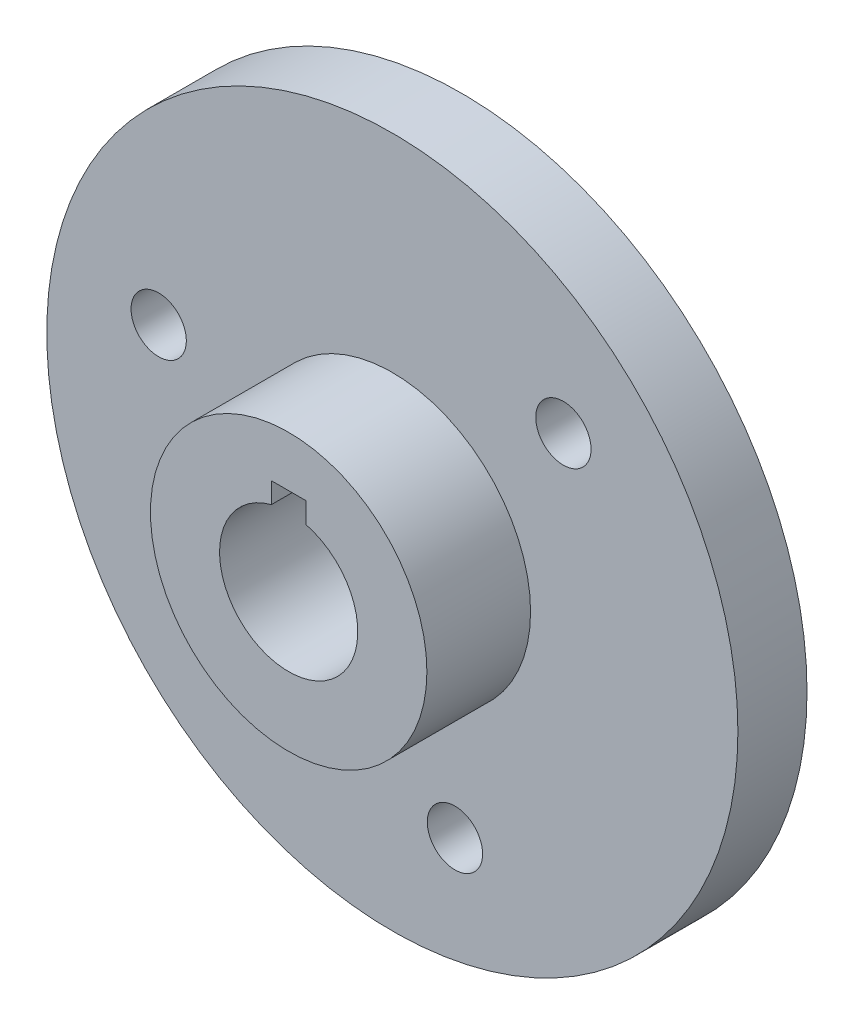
ISO-10303-21;
HEADER;
FILE_DESCRIPTION(('STEP AP214'),'2;1');
FILE_NAME('part.step','',(''),(''),'','','');
FILE_SCHEMA(('AUTOMOTIVE_DESIGN { 1 0 10303 214 1 1 1 1 }'));
ENDSEC;
DATA;
#1=APPLICATION_CONTEXT('core data for automotive mechanical design processes');
#2=APPLICATION_PROTOCOL_DEFINITION('international standard','automotive_design',2000,#1);
#3=PRODUCT_CONTEXT('',#1,'mechanical');
#4=PRODUCT('Part','Part','',(#3));
#5=PRODUCT_RELATED_PRODUCT_CATEGORY('part','',(#4));
#6=PRODUCT_DEFINITION_FORMATION('','',#4);
#7=PRODUCT_DEFINITION_CONTEXT('part definition',#1,'design');
#8=PRODUCT_DEFINITION('design','',#6,#7);
#9=PRODUCT_DEFINITION_SHAPE('','',#8);
#10=(LENGTH_UNIT() NAMED_UNIT(*) SI_UNIT(.MILLI.,.METRE.));
#11=(NAMED_UNIT(*) PLANE_ANGLE_UNIT() SI_UNIT($,.RADIAN.));
#12=(NAMED_UNIT(*) SI_UNIT($,.STERADIAN.) SOLID_ANGLE_UNIT());
#13=UNCERTAINTY_MEASURE_WITH_UNIT(LENGTH_MEASURE(1.E-05),#10,'distance_accuracy_value','');
#14=(GEOMETRIC_REPRESENTATION_CONTEXT(3) GLOBAL_UNCERTAINTY_ASSIGNED_CONTEXT((#13)) GLOBAL_UNIT_ASSIGNED_CONTEXT((#10,
#11,#12)) REPRESENTATION_CONTEXT('',''));
#15=CARTESIAN_POINT('',(0.,0.,0.));
#16=DIRECTION('',(0.,0.,1.));
#17=DIRECTION('',(1.,0.,0.));
#18=AXIS2_PLACEMENT_3D('',#15,#16,#17);
#19=CARTESIAN_POINT('',(0.,0.,0.));
#20=DIRECTION('',(0.,0.,-1.));
#21=DIRECTION('',(-1.,0.,0.));
#22=AXIS2_PLACEMENT_3D('',#19,#20,#21);
#23=PLANE('',#22);
#24=CARTESIAN_POINT('',(0.,0.,0.));
#25=DIRECTION('',(0.,0.,1.));
#26=DIRECTION('',(1.,0.,0.));
#27=AXIS2_PLACEMENT_3D('',#24,#25,#26);
#28=CIRCLE('',#27,10.);
#29=CARTESIAN_POINT('',(-2.5,9.68245836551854,0.));
#30=VERTEX_POINT('',#29);
#31=CARTESIAN_POINT('',(2.5,9.68245836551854,0.));
#32=VERTEX_POINT('',#31);
#33=EDGE_CURVE('E121',#30,#32,#28,.T.);
#34=ORIENTED_EDGE('',*,*,#33,.F.);
#35=DIRECTION('',(0.,-1.,0.));
#36=VECTOR('',#35,1.);
#37=CARTESIAN_POINT('',(-2.5,9.68245836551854,0.));
#38=LINE('',#37,#36);
#39=CARTESIAN_POINT('',(-2.5,12.6824583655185,0.));
#40=VERTEX_POINT('',#39);
#41=EDGE_CURVE('E71',#40,#30,#38,.T.);
#42=ORIENTED_EDGE('',*,*,#41,.F.);
#43=DIRECTION('',(-1.,0.,0.));
#44=VECTOR('',#43,1.);
#45=CARTESIAN_POINT('',(2.5,12.6824583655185,0.));
#46=LINE('',#45,#44);
#47=CARTESIAN_POINT('',(2.5,12.6824583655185,0.));
#48=VERTEX_POINT('',#47);
#49=EDGE_CURVE('E96',#48,#40,#46,.T.);
#50=ORIENTED_EDGE('',*,*,#49,.F.);
#51=DIRECTION('',(0.,1.,0.));
#52=VECTOR('',#51,1.);
#53=CARTESIAN_POINT('',(2.5,9.68245836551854,0.));
#54=LINE('',#53,#52);
#55=EDGE_CURVE('E77',#32,#48,#54,.T.);
#56=ORIENTED_EDGE('',*,*,#55,.F.);
#57=EDGE_LOOP('',(#34,#42,#50,#56));
#58=FACE_BOUND('',#57,.T.);
#59=CARTESIAN_POINT('',(0.,0.,0.));
#60=DIRECTION('',(0.,0.,1.));
#61=DIRECTION('',(1.,0.,0.));
#62=AXIS2_PLACEMENT_3D('',#59,#60,#61);
#63=CIRCLE('',#62,20.);
#64=CARTESIAN_POINT('',(20.,0.,0.));
#65=VERTEX_POINT('',#64);
#66=EDGE_CURVE('E11',#65,#65,#63,.T.);
#67=ORIENTED_EDGE('',*,*,#66,.T.);
#68=EDGE_LOOP('',(#67));
#69=FACE_BOUND('',#68,.T.);
#70=ADVANCED_FACE('F32',(#58,#69),#23,.F.);
#71=CARTESIAN_POINT('',(0.,0.,0.));
#72=DIRECTION('',(0.,0.,1.));
#73=DIRECTION('',(1.,0.,0.));
#74=AXIS2_PLACEMENT_3D('',#71,#72,#73);
#75=CYLINDRICAL_SURFACE('',#74,20.);
#76=ORIENTED_EDGE('',*,*,#66,.F.);
#77=EDGE_LOOP('',(#76));
#78=FACE_BOUND('',#77,.T.);
#79=CARTESIAN_POINT('',(0.,0.,-15.));
#80=DIRECTION('',(0.,0.,1.));
#81=DIRECTION('',(1.,0.,0.));
#82=AXIS2_PLACEMENT_3D('',#79,#80,#81);
#83=CIRCLE('',#82,20.);
#84=CARTESIAN_POINT('',(20.,0.,-15.));
#85=VERTEX_POINT('',#84);
#86=EDGE_CURVE('E39',#85,#85,#83,.T.);
#87=ORIENTED_EDGE('',*,*,#86,.T.);
#88=EDGE_LOOP('',(#87));
#89=FACE_BOUND('',#88,.T.);
#90=ADVANCED_FACE('F135',(#78,#89),#75,.T.);
#91=CARTESIAN_POINT('',(0.,20.,-15.));
#92=DIRECTION('',(0.,0.,-1.));
#93=DIRECTION('',(-1.,0.,0.));
#94=AXIS2_PLACEMENT_3D('',#91,#92,#93);
#95=PLANE('',#94);
#96=CARTESIAN_POINT('',(9.05866657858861,-33.8074039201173,-15.));
#97=DIRECTION('',(0.,0.,1.));
#98=DIRECTION('',(-0.499999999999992,-0.866025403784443,0.));
#99=AXIS2_PLACEMENT_3D('',#96,#97,#98);
#100=CIRCLE('',#99,4.);
#101=CARTESIAN_POINT('',(7.05866657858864,-37.2715055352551,-15.));
#102=VERTEX_POINT('',#101);
#103=EDGE_CURVE('E103',#102,#102,#100,.T.);
#104=ORIENTED_EDGE('',*,*,#103,.F.);
#105=EDGE_LOOP('',(#104));
#106=FACE_BOUND('',#105,.T.);
#107=CARTESIAN_POINT('',(-33.8074039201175,9.05866657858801,-15.));
#108=DIRECTION('',(0.,0.,1.));
#109=DIRECTION('',(-0.500000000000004,0.866025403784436,0.));
#110=AXIS2_PLACEMENT_3D('',#107,#108,#109);
#111=CIRCLE('',#110,4.);
#112=CARTESIAN_POINT('',(-35.8074039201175,12.5227681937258,-15.));
#113=VERTEX_POINT('',#112);
#114=EDGE_CURVE('E109',#113,#113,#111,.T.);
#115=ORIENTED_EDGE('',*,*,#114,.F.);
#116=EDGE_LOOP('',(#115));
#117=FACE_BOUND('',#116,.T.);
#118=CARTESIAN_POINT('',(24.7487373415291,24.7487373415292,-15.));
#119=DIRECTION('',(0.,0.,1.));
#120=DIRECTION('',(1.,0.,0.));
#121=AXIS2_PLACEMENT_3D('',#118,#119,#120);
#122=CIRCLE('',#121,4.);
#123=CARTESIAN_POINT('',(28.7487373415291,24.7487373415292,-15.));
#124=VERTEX_POINT('',#123);
#125=EDGE_CURVE('E115',#124,#124,#122,.T.);
#126=ORIENTED_EDGE('',*,*,#125,.F.);
#127=EDGE_LOOP('',(#126));
#128=FACE_BOUND('',#127,.T.);
#129=ORIENTED_EDGE('',*,*,#86,.F.);
#130=EDGE_LOOP('',(#129));
#131=FACE_BOUND('',#130,.T.);
#132=CARTESIAN_POINT('',(0.,0.,-15.));
#133=DIRECTION('',(0.,0.,1.));
#134=DIRECTION('',(1.,0.,0.));
#135=AXIS2_PLACEMENT_3D('',#132,#133,#134);
#136=CIRCLE('',#135,50.);
#137=CARTESIAN_POINT('',(50.,0.,-15.));
#138=VERTEX_POINT('',#137);
#139=EDGE_CURVE('E130',#138,#138,#136,.T.);
#140=ORIENTED_EDGE('',*,*,#139,.T.);
#141=EDGE_LOOP('',(#140));
#142=FACE_BOUND('',#141,.T.);
#143=ADVANCED_FACE('F137',(#106,#117,#128,#131,#142),#95,.F.);
#144=CARTESIAN_POINT('',(0.,0.,0.));
#145=DIRECTION('',(0.,0.,1.));
#146=DIRECTION('',(1.,0.,0.));
#147=AXIS2_PLACEMENT_3D('',#144,#145,#146);
#148=CYLINDRICAL_SURFACE('',#147,50.);
#149=ORIENTED_EDGE('',*,*,#139,.F.);
#150=EDGE_LOOP('',(#149));
#151=FACE_BOUND('',#150,.T.);
#152=CARTESIAN_POINT('',(0.,0.,-25.));
#153=DIRECTION('',(0.,0.,1.));
#154=DIRECTION('',(1.,0.,0.));
#155=AXIS2_PLACEMENT_3D('',#152,#153,#154);
#156=CIRCLE('',#155,50.);
#157=CARTESIAN_POINT('',(50.,0.,-25.));
#158=VERTEX_POINT('',#157);
#159=EDGE_CURVE('E125',#158,#158,#156,.T.);
#160=ORIENTED_EDGE('',*,*,#159,.T.);
#161=EDGE_LOOP('',(#160));
#162=FACE_BOUND('',#161,.T.);
#163=ADVANCED_FACE('F140',(#151,#162),#148,.T.);
#164=CARTESIAN_POINT('',(0.,50.,-25.));
#165=DIRECTION('',(0.,0.,1.));
#166=DIRECTION('',(1.,0.,0.));
#167=AXIS2_PLACEMENT_3D('',#164,#165,#166);
#168=PLANE('',#167);
#169=CARTESIAN_POINT('',(9.05866657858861,-33.8074039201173,-25.));
#170=DIRECTION('',(0.,0.,1.));
#171=DIRECTION('',(-0.499999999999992,-0.866025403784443,0.));
#172=AXIS2_PLACEMENT_3D('',#169,#170,#171);
#173=CIRCLE('',#172,4.);
#174=CARTESIAN_POINT('',(7.05866657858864,-37.2715055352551,-25.));
#175=VERTEX_POINT('',#174);
#176=EDGE_CURVE('E106',#175,#175,#173,.T.);
#177=ORIENTED_EDGE('',*,*,#176,.T.);
#178=EDGE_LOOP('',(#177));
#179=FACE_BOUND('',#178,.T.);
#180=CARTESIAN_POINT('',(-33.8074039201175,9.05866657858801,-25.));
#181=DIRECTION('',(0.,0.,1.));
#182=DIRECTION('',(-0.500000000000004,0.866025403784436,0.));
#183=AXIS2_PLACEMENT_3D('',#180,#181,#182);
#184=CIRCLE('',#183,4.);
#185=CARTESIAN_POINT('',(-35.8074039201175,12.5227681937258,-25.));
#186=VERTEX_POINT('',#185);
#187=EDGE_CURVE('E112',#186,#186,#184,.T.);
#188=ORIENTED_EDGE('',*,*,#187,.T.);
#189=EDGE_LOOP('',(#188));
#190=FACE_BOUND('',#189,.T.);
#191=CARTESIAN_POINT('',(24.7487373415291,24.7487373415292,-25.));
#192=DIRECTION('',(0.,0.,1.));
#193=DIRECTION('',(1.,0.,0.));
#194=AXIS2_PLACEMENT_3D('',#191,#192,#193);
#195=CIRCLE('',#194,4.);
#196=CARTESIAN_POINT('',(28.7487373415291,24.7487373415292,-25.));
#197=VERTEX_POINT('',#196);
#198=EDGE_CURVE('E118',#197,#197,#195,.T.);
#199=ORIENTED_EDGE('',*,*,#198,.T.);
#200=EDGE_LOOP('',(#199));
#201=FACE_BOUND('',#200,.T.);
#202=DIRECTION('',(-1.,0.,0.));
#203=VECTOR('',#202,1.);
#204=CARTESIAN_POINT('',(2.5,12.6824583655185,-25.));
#205=LINE('',#204,#203);
#206=CARTESIAN_POINT('',(2.5,12.6824583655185,-25.));
#207=VERTEX_POINT('',#206);
#208=CARTESIAN_POINT('',(-2.5,12.6824583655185,-25.));
#209=VERTEX_POINT('',#208);
#210=EDGE_CURVE('E85',#207,#209,#205,.T.);
#211=ORIENTED_EDGE('',*,*,#210,.T.);
#212=DIRECTION('',(0.,-1.,0.));
#213=VECTOR('',#212,1.);
#214=CARTESIAN_POINT('',(-2.5,9.68245836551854,-25.));
#215=LINE('',#214,#213);
#216=CARTESIAN_POINT('',(-2.5,9.68245836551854,-25.));
#217=VERTEX_POINT('',#216);
#218=EDGE_CURVE('E88',#209,#217,#215,.T.);
#219=ORIENTED_EDGE('',*,*,#218,.T.);
#220=CARTESIAN_POINT('',(0.,0.,-25.));
#221=DIRECTION('',(0.,0.,1.));
#222=DIRECTION('',(1.,0.,0.));
#223=AXIS2_PLACEMENT_3D('',#220,#221,#222);
#224=CIRCLE('',#223,10.);
#225=CARTESIAN_POINT('',(2.5,9.68245836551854,-25.));
#226=VERTEX_POINT('',#225);
#227=EDGE_CURVE('E94',#217,#226,#224,.T.);
#228=ORIENTED_EDGE('',*,*,#227,.T.);
#229=DIRECTION('',(0.,1.,0.));
#230=VECTOR('',#229,1.);
#231=CARTESIAN_POINT('',(2.5,9.68245836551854,-25.));
#232=LINE('',#231,#230);
#233=EDGE_CURVE('E46',#226,#207,#232,.T.);
#234=ORIENTED_EDGE('',*,*,#233,.T.);
#235=EDGE_LOOP('',(#211,#219,#228,#234));
#236=FACE_BOUND('',#235,.T.);
#237=ORIENTED_EDGE('',*,*,#159,.F.);
#238=EDGE_LOOP('',(#237));
#239=FACE_BOUND('',#238,.T.);
#240=ADVANCED_FACE('F91',(#179,#190,#201,#236,#239),#168,.F.);
#241=CARTESIAN_POINT('',(0.,0.,-25.));
#242=DIRECTION('',(0.,0.,1.));
#243=DIRECTION('',(1.,0.,0.));
#244=AXIS2_PLACEMENT_3D('',#241,#242,#243);
#245=CYLINDRICAL_SURFACE('',#244,10.);
#246=ORIENTED_EDGE('',*,*,#227,.F.);
#247=DIRECTION('',(0.,0.,1.));
#248=VECTOR('',#247,1.);
#249=CARTESIAN_POINT('',(-2.5,9.68245836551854,-25.));
#250=LINE('',#249,#248);
#251=EDGE_CURVE('E55',#217,#30,#250,.T.);
#252=ORIENTED_EDGE('',*,*,#251,.T.);
#253=ORIENTED_EDGE('',*,*,#33,.T.);
#254=DIRECTION('',(0.,0.,1.));
#255=VECTOR('',#254,1.);
#256=CARTESIAN_POINT('',(2.5,9.68245836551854,-25.));
#257=LINE('',#256,#255);
#258=EDGE_CURVE('E82',#226,#32,#257,.T.);
#259=ORIENTED_EDGE('',*,*,#258,.F.);
#260=EDGE_LOOP('',(#246,#252,#253,#259));
#261=FACE_BOUND('',#260,.T.);
#262=ADVANCED_FACE('F150',(#261),#245,.F.);
#263=CARTESIAN_POINT('',(24.7487373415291,24.7487373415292,-25.));
#264=DIRECTION('',(0.,0.,1.));
#265=DIRECTION('',(1.,0.,0.));
#266=AXIS2_PLACEMENT_3D('',#263,#264,#265);
#267=CYLINDRICAL_SURFACE('',#266,4.);
#268=ORIENTED_EDGE('',*,*,#198,.F.);
#269=EDGE_LOOP('',(#268));
#270=FACE_BOUND('',#269,.T.);
#271=ORIENTED_EDGE('',*,*,#125,.T.);
#272=EDGE_LOOP('',(#271));
#273=FACE_BOUND('',#272,.T.);
#274=ADVANCED_FACE('F156',(#270,#273),#267,.F.);
#275=CARTESIAN_POINT('',(-33.8074039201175,9.05866657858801,-25.));
#276=DIRECTION('',(0.,0.,1.));
#277=DIRECTION('',(1.,0.,0.));
#278=AXIS2_PLACEMENT_3D('',#275,#276,#277);
#279=CYLINDRICAL_SURFACE('',#278,4.);
#280=ORIENTED_EDGE('',*,*,#187,.F.);
#281=EDGE_LOOP('',(#280));
#282=FACE_BOUND('',#281,.T.);
#283=ORIENTED_EDGE('',*,*,#114,.T.);
#284=EDGE_LOOP('',(#283));
#285=FACE_BOUND('',#284,.T.);
#286=ADVANCED_FACE('F189',(#282,#285),#279,.F.);
#287=CARTESIAN_POINT('',(9.05866657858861,-33.8074039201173,-25.));
#288=DIRECTION('',(0.,0.,1.));
#289=DIRECTION('',(1.,0.,0.));
#290=AXIS2_PLACEMENT_3D('',#287,#288,#289);
#291=CYLINDRICAL_SURFACE('',#290,4.);
#292=ORIENTED_EDGE('',*,*,#176,.F.);
#293=EDGE_LOOP('',(#292));
#294=FACE_BOUND('',#293,.T.);
#295=ORIENTED_EDGE('',*,*,#103,.T.);
#296=EDGE_LOOP('',(#295));
#297=FACE_BOUND('',#296,.T.);
#298=ADVANCED_FACE('F202',(#294,#297),#291,.F.);
#299=CARTESIAN_POINT('',(-2.5,9.68245836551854,-25.));
#300=DIRECTION('',(-1.,0.,0.));
#301=DIRECTION('',(0.,0.,1.));
#302=AXIS2_PLACEMENT_3D('',#299,#300,#301);
#303=PLANE('',#302);
#304=ORIENTED_EDGE('',*,*,#41,.T.);
#305=ORIENTED_EDGE('',*,*,#251,.F.);
#306=ORIENTED_EDGE('',*,*,#218,.F.);
#307=DIRECTION('',(0.,0.,1.));
#308=VECTOR('',#307,1.);
#309=CARTESIAN_POINT('',(-2.5,12.6824583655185,-25.));
#310=LINE('',#309,#308);
#311=EDGE_CURVE('E81',#209,#40,#310,.T.);
#312=ORIENTED_EDGE('',*,*,#311,.T.);
#313=EDGE_LOOP('',(#304,#305,#306,#312));
#314=FACE_BOUND('',#313,.T.);
#315=ADVANCED_FACE('F209',(#314),#303,.F.);
#316=CARTESIAN_POINT('',(2.5,12.6824583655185,-25.));
#317=DIRECTION('',(0.,1.,0.));
#318=DIRECTION('',(0.,0.,1.));
#319=AXIS2_PLACEMENT_3D('',#316,#317,#318);
#320=PLANE('',#319);
#321=ORIENTED_EDGE('',*,*,#49,.T.);
#322=ORIENTED_EDGE('',*,*,#311,.F.);
#323=ORIENTED_EDGE('',*,*,#210,.F.);
#324=DIRECTION('',(0.,0.,1.));
#325=VECTOR('',#324,1.);
#326=CARTESIAN_POINT('',(2.5,12.6824583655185,-25.));
#327=LINE('',#326,#325);
#328=EDGE_CURVE('E73',#207,#48,#327,.T.);
#329=ORIENTED_EDGE('',*,*,#328,.T.);
#330=EDGE_LOOP('',(#321,#322,#323,#329));
#331=FACE_BOUND('',#330,.T.);
#332=ADVANCED_FACE('F86',(#331),#320,.F.);
#333=CARTESIAN_POINT('',(2.5,9.68245836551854,-25.));
#334=DIRECTION('',(1.,0.,0.));
#335=DIRECTION('',(0.,0.,-1.));
#336=AXIS2_PLACEMENT_3D('',#333,#334,#335);
#337=PLANE('',#336);
#338=ORIENTED_EDGE('',*,*,#55,.T.);
#339=ORIENTED_EDGE('',*,*,#328,.F.);
#340=ORIENTED_EDGE('',*,*,#233,.F.);
#341=ORIENTED_EDGE('',*,*,#258,.T.);
#342=EDGE_LOOP('',(#338,#339,#340,#341));
#343=FACE_BOUND('',#342,.T.);
#344=ADVANCED_FACE('F75',(#343),#337,.F.);
#345=CLOSED_SHELL('',(#70,#90,#143,#163,#240,#262,#274,#286,#298,#315,#332,#344));
#346=MANIFOLD_SOLID_BREP('B2',#345);
#347=ADVANCED_BREP_SHAPE_REPRESENTATION('',(#18,#346),#14);
#348=SHAPE_DEFINITION_REPRESENTATION(#9,#347);
ENDSEC;
END-ISO-10303-21;
